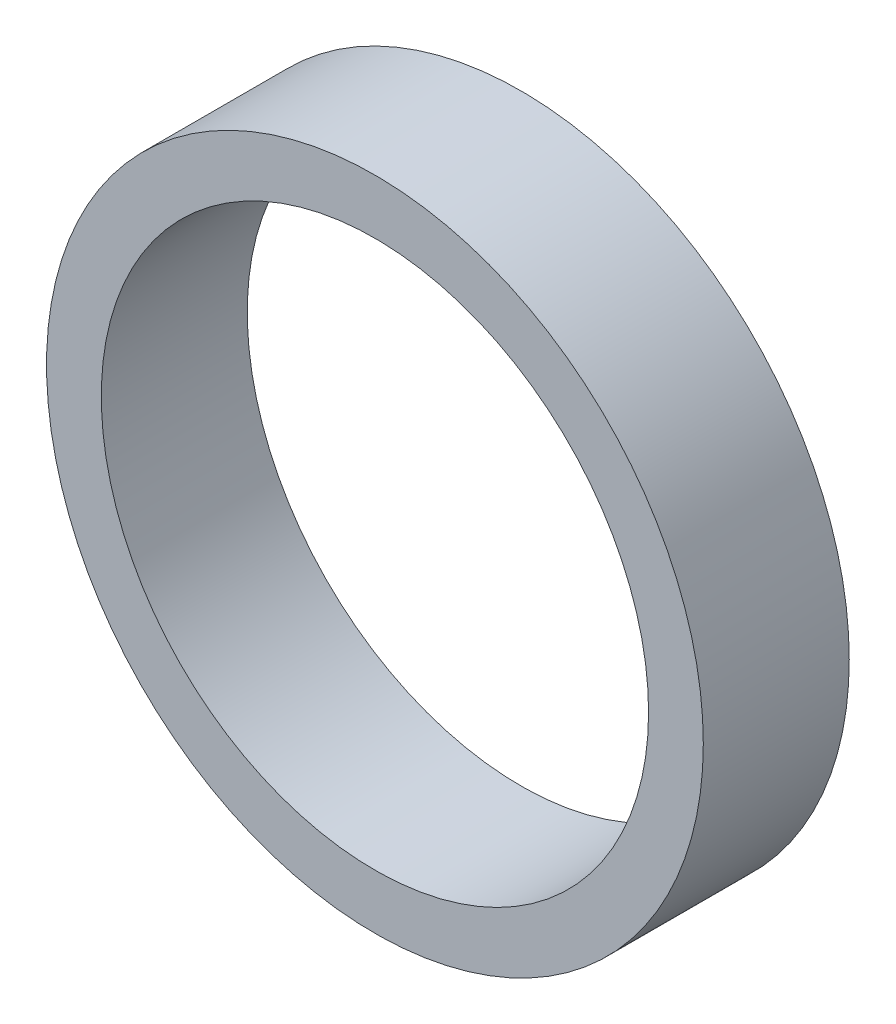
from build123d import *

# Parameters (mm, degrees)
SKIZZE1_R                       = 18
SKIZZE1_R_2                     = 15
AUFSATZ_LINEAR_AUSTRAGEN1_DEPTH = 8


with BuildPart() as part:
    # Skizze1 → Aufsatz-Linear austragen1 (new body)
    with BuildSketch(Plane.XY):
        Circle(SKIZZE1_R)
        Circle(SKIZZE1_R_2, mode=Mode.SUBTRACT)
    extrude(amount=AUFSATZ_LINEAR_AUSTRAGEN1_DEPTH)


solid = part.part
